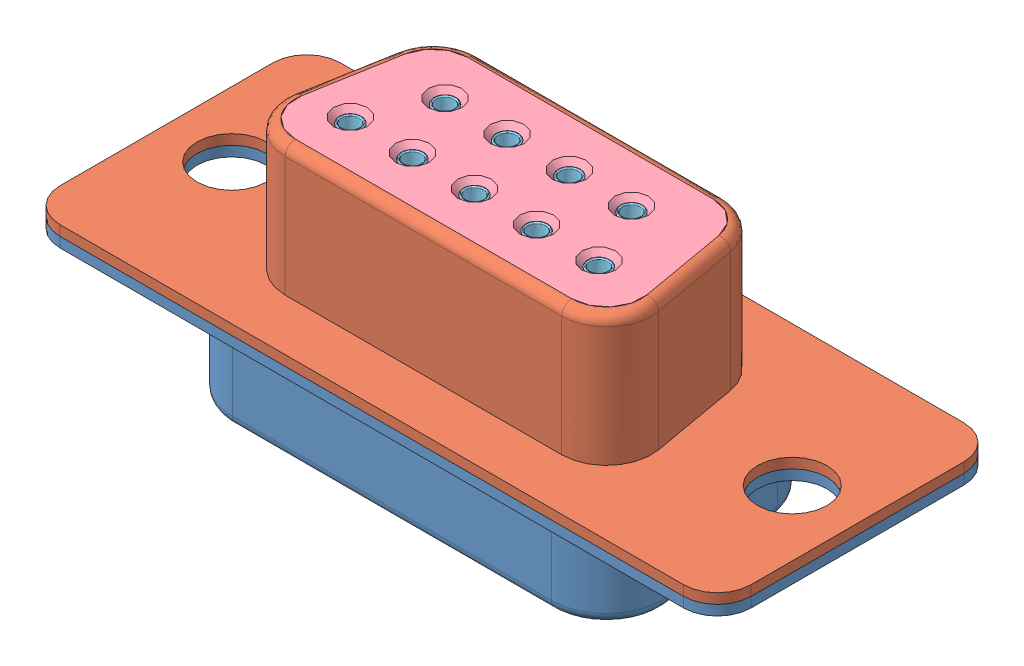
SolidWorks assembly Connect.SLDASM, configuration Défaut (file format 7000). Lengths in mm.
Overall size (30.81 11.5 12.5).
13 component instances, 5 part files, 27 mates.
Components (placement in the parent):
- Connect1-1: Connect1.SLDPRT [Default] at (-0.1024 -0.5565 30.81) size (30.81 4.46 12.5)
- Connect2-1: Connect2.SLDPRT [Default] at (-0.1024 -0.5565 30.81) size (30.81 6.25 12.5)
- Connect3-1: Connect3.SLDPRT [Default] at (-0.1024 -0.5565 30.81) size (18.23 2.95 9.8)
- Connect4-1: Connect4.SLDPRT [Default] at (-0.1024 -0.5565 30.81) size (18.23 9.5 9.8)
- Connect5-1: Connect5.SLDPRT [Défaut] at (-3.1224 -5.5065 32.23) x (0 1 0) z (0.824964 0 0.565185) size (11 1.8 1.8)
- Connect5-2: Connect5.SLDPRT [Défaut] at (-0.3524 -5.5065 32.23) x (0 1 0) z (-0.02103 0 -0.999779) size (11 1.8 1.8)
- Connect5-3: Connect5.SLDPRT [Défaut] at (-1.7374 -5.5065 29.39) x (0 1 0) z (-0.130756 0 -0.991415) size (11 1.8 1.8)
- Connect5-4: Connect5.SLDPRT [Défaut] at (2.4176 -5.5065 32.23) x (0 1 0) z (-0.405452 0 -0.914116) size (11 1.8 1.8)
- Connect5-5: Connect5.SLDPRT [Défaut] at (-5.8924 -5.5065 32.23) x (0 1 0) z (-0.231709 0 -0.972785) size (11 1.8 1.8)
- Connect5-6: Connect5.SLDPRT [Défaut] at (5.1876 -5.5065 32.23) x (0 1 0) z (0.713546 0 -0.700608) size (11 1.8 1.8)
- Connect5-7: Connect5.SLDPRT [Défaut] at (-4.5074 -5.5065 29.39) x (0 1 0) z (0.131771 0 -0.99128) size (11 1.8 1.8)
- Connect5-8: Connect5.SLDPRT [Défaut] at (1.0326 -5.5065 29.39) x (0 1 0) z (0.466886 0 -0.884317) size (11 1.8 1.8)
- Connect5-10: Connect5.SLDPRT [Défaut] at (3.8026 -5.5065 29.39) x (0 1 0) z (-0.407564 0 -0.913177) size (11 1.8 1.8)
Mates (geometry in assembly coordinates):
- Coïncidente1: coincident anti-aligned: plane of Connect3-1 through (-7.2174 -2.8565 33.71) normal (0 1 0); plane of Connect4-1 through (-7.2174 -2.8565 33.71) normal (0 -1 0)
- Coïncidente2: coincident aligned: plane of Connect3-1 through (-8.1643 -5.8065 27.5627) normal (-0.984808 0 -0.173648); plane of Connect4-1 through (-8.1643 -2.8565 27.5627) normal (-0.984808 0 -0.173648)
- Coïncidente3: coincident aligned: plane of Connect3-1 through (-7.2174 -5.8065 35.71) normal (0 0 1); plane of Connect4-1 through (-7.2174 -2.8565 35.71) normal (0 0 1)
- Coïncidente4: coincident anti-aligned: plane of Connect1-1 through (5.3426 -34.1021 27.36) normal (0 0 1); plane of Connect3-1 through (-5.5473 -4.5565 27.36) normal (0 0 -1)
- Coïncidente5: coincident anti-aligned: plane of Connect1-1 through (-7.0738 -34.1021 28.6408) normal (0.984808 0 0.173648); plane of Connect3-1 through (-7.7438 -4.5565 32.4408) normal (-0.984808 0 -0.173648)
- Coïncidente6: coincident anti-aligned: plane of Connect1-1 through (-7.2174 -4.5565 33.71) normal (0 1 0); plane of Connect3-1 through (-7.2174 -4.5565 33.71) normal (0 -1 0)
- Coïncidente7: coincident anti-aligned: plane of Connect2-1 through (-7.7938 5.6935 32.4908) normal (0.984808 0 0.173648); plane of Connect4-1 through (-7.7938 5.6935 32.4908) normal (-0.984808 0 -0.173648)
- Coïncidente8: coincident anti-aligned: plane of Connect2-1 through (6.0626 5.6935 34.31) normal (0 0 -1); plane of Connect4-1 through (6.0626 5.6935 34.31) normal (0 0 1)
- Coïncidente9: coincident anti-aligned: plane of Connect1-1 through (-15.5074 -0.5565 37.06) normal (0 1 0); plane of Connect2-1 through (15.3026 -0.5565 37.06) normal (0 -1 0)
- Coaxiale1: concentric anti-aligned: cylinder of Connect3-1 through (-5.8924 -23.7628 32.23) axis (0 1 0) radius 0.75; cylinder of Connect5-5 through (-5.8924 -10.5039 32.23) axis (0 -1 0) radius 0.9
- Coaxiale2: concentric anti-aligned: cylinder of Connect3-1 through (-3.1224 -23.7628 32.23) axis (0 1 0) radius 0.75; cylinder of Connect5-1 through (-3.1224 -10.5039 32.23) axis (0 -1 0) radius 0.9
- Coaxiale3: concentric anti-aligned: cylinder of Connect3-1 through (-0.3524 -23.7628 32.23) axis (0 1 0) radius 0.75; cylinder of Connect5-2 through (-0.3524 -10.5039 32.23) axis (0 -1 0) radius 0.9
- Coaxiale4: concentric anti-aligned: cylinder of Connect3-1 through (2.4176 -23.7628 32.23) axis (0 1 0) radius 0.75; cylinder of Connect5-4 through (2.4176 -10.5039 32.23) axis (0 -1 0) radius 0.9
- Coaxiale5: concentric anti-aligned: cylinder of Connect3-1 through (5.1876 -23.7628 32.23) axis (0 1 0) radius 0.75; cylinder of Connect5-6 through (5.1876 -10.5039 32.23) axis (0 -1 0) radius 0.9
- Coaxiale6: concentric anti-aligned: cylinder of Connect3-1 through (-4.5074 -23.7628 29.39) axis (0 1 0) radius 0.75; cylinder of Connect5-7 through (-4.5074 -10.5039 29.39) axis (0 -1 0) radius 0.9
- Coaxiale7: concentric anti-aligned: cylinder of Connect3-1 through (-1.7374 -23.7628 29.39) axis (0 1 0) radius 0.75; cylinder of Connect5-3 through (-1.7374 -10.5039 29.39) axis (0 -1 0) radius 0.9
- Coaxiale8: concentric anti-aligned: cylinder of Connect3-1 through (1.0326 -23.7628 29.39) axis (0 1 0) radius 0.75; cylinder of Connect5-8 through (1.0326 -10.5039 29.39) axis (0 -1 0) radius 0.9
- Coaxiale9: concentric anti-aligned: cylinder of Connect3-1 through (3.8026 -23.7628 29.39) axis (0 1 0) radius 0.75; cylinder of Connect5-10 through (3.8026 -10.5039 29.39) axis (0 -1 0) radius 0.9
- Coïncidente16: coincident anti-aligned: circle of Connect4-1; circle of Connect5-7
- Coïncidente17: coincident anti-aligned: circle of Connect4-1; circle of Connect5-5
- Coïncidente18: coincident anti-aligned: circle of Connect4-1; circle of Connect5-1
- Coïncidente19: coincident anti-aligned: circle of Connect4-1; circle of Connect5-3
- Coïncidente20: coincident anti-aligned: circle of Connect4-1; circle of Connect5-2
- Coïncidente22: coincident anti-aligned: circle of Connect4-1; circle of Connect5-8
- Coïncidente23: coincident anti-aligned: circle of Connect4-1; circle of Connect5-4
- Coïncidente24: coincident anti-aligned: circle of Connect4-1; circle of Connect5-10
- Coïncidente25: coincident anti-aligned: circle of Connect4-1; circle of Connect5-6
